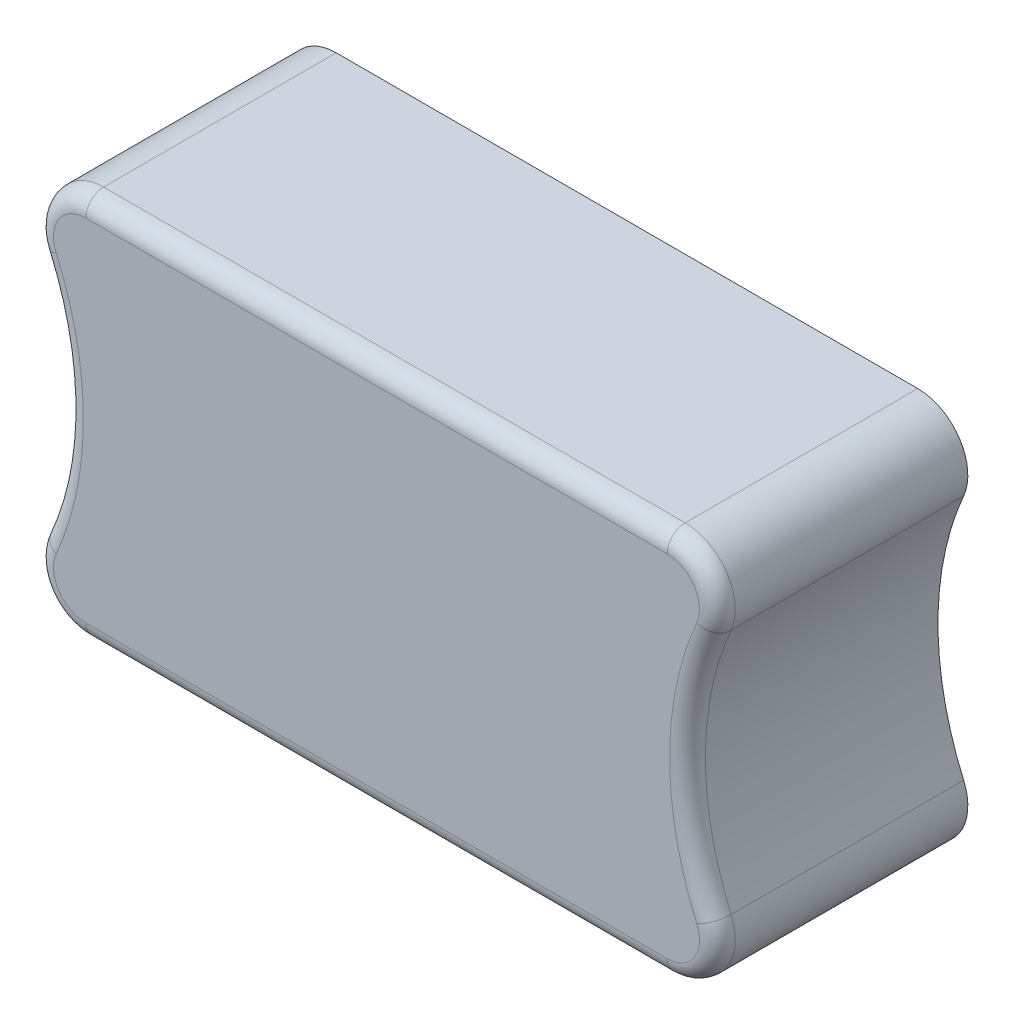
ISO-10303-21;
HEADER;
FILE_DESCRIPTION(('STEP AP214'),'2;1');
FILE_NAME('part.step','',(''),(''),'','','');
FILE_SCHEMA(('AUTOMOTIVE_DESIGN { 1 0 10303 214 1 1 1 1 }'));
ENDSEC;
DATA;
#1=APPLICATION_CONTEXT('core data for automotive mechanical design processes');
#2=APPLICATION_PROTOCOL_DEFINITION('international standard','automotive_design',2000,#1);
#3=PRODUCT_CONTEXT('',#1,'mechanical');
#4=PRODUCT('Part','Part','',(#3));
#5=PRODUCT_RELATED_PRODUCT_CATEGORY('part','',(#4));
#6=PRODUCT_DEFINITION_FORMATION('','',#4);
#7=PRODUCT_DEFINITION_CONTEXT('part definition',#1,'design');
#8=PRODUCT_DEFINITION('design','',#6,#7);
#9=PRODUCT_DEFINITION_SHAPE('','',#8);
#10=(LENGTH_UNIT() NAMED_UNIT(*) SI_UNIT(.MILLI.,.METRE.));
#11=(NAMED_UNIT(*) PLANE_ANGLE_UNIT() SI_UNIT($,.RADIAN.));
#12=(NAMED_UNIT(*) SI_UNIT($,.STERADIAN.) SOLID_ANGLE_UNIT());
#13=UNCERTAINTY_MEASURE_WITH_UNIT(LENGTH_MEASURE(1.E-05),#10,'distance_accuracy_value','');
#14=(GEOMETRIC_REPRESENTATION_CONTEXT(3) GLOBAL_UNCERTAINTY_ASSIGNED_CONTEXT((#13)) GLOBAL_UNIT_ASSIGNED_CONTEXT((#10,
#11,#12)) REPRESENTATION_CONTEXT('',''));
#15=CARTESIAN_POINT('',(0.,0.,0.));
#16=DIRECTION('',(0.,0.,1.));
#17=DIRECTION('',(1.,0.,0.));
#18=AXIS2_PLACEMENT_3D('',#15,#16,#17);
#19=CARTESIAN_POINT('',(86.4575131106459,0.,-35.));
#20=DIRECTION('',(0.,0.,1.));
#21=DIRECTION('',(1.,0.,0.));
#22=AXIS2_PLACEMENT_3D('',#19,#20,#21);
#23=CYLINDRICAL_SURFACE('',#22,43.);
#24=DIRECTION('',(0.,0.,1.));
#25=VECTOR('',#24,1.);
#26=CARTESIAN_POINT('',(47.0473621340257,17.2,-35.));
#27=LINE('',#26,#25);
#28=CARTESIAN_POINT('',(47.0473621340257,17.2,-35.));
#29=VERTEX_POINT('',#28);
#30=CARTESIAN_POINT('',(47.0473621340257,17.2,-2.5));
#31=VERTEX_POINT('',#30);
#32=EDGE_CURVE('E272',#29,#31,#27,.T.);
#33=ORIENTED_EDGE('',*,*,#32,.T.);
#34=CARTESIAN_POINT('',(86.4575131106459,0.,-2.5));
#35=DIRECTION('',(0.,0.,1.));
#36=DIRECTION('',(1.,0.,0.));
#37=AXIS2_PLACEMENT_3D('',#34,#35,#36);
#38=CIRCLE('',#37,43.);
#39=CARTESIAN_POINT('',(47.0473621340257,-17.2,-2.5));
#40=VERTEX_POINT('',#39);
#41=EDGE_CURVE('E11',#31,#40,#38,.T.);
#42=ORIENTED_EDGE('',*,*,#41,.T.);
#43=DIRECTION('',(0.,0.,1.));
#44=VECTOR('',#43,1.);
#45=CARTESIAN_POINT('',(47.0473621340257,-17.2,-35.));
#46=LINE('',#45,#44);
#47=CARTESIAN_POINT('',(47.0473621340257,-17.2,-35.));
#48=VERTEX_POINT('',#47);
#49=EDGE_CURVE('E273',#48,#40,#46,.T.);
#50=ORIENTED_EDGE('',*,*,#49,.F.);
#51=CARTESIAN_POINT('',(86.4575131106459,0.,-35.));
#52=DIRECTION('',(0.,0.,-1.));
#53=DIRECTION('',(1.,0.,0.));
#54=AXIS2_PLACEMENT_3D('',#51,#52,#53);
#55=CIRCLE('',#54,43.);
#56=EDGE_CURVE('E248',#48,#29,#55,.T.);
#57=ORIENTED_EDGE('',*,*,#56,.T.);
#58=EDGE_LOOP('',(#33,#42,#50,#57));
#59=FACE_BOUND('',#58,.T.);
#60=ADVANCED_FACE('F37',(#59),#23,.F.);
#61=CARTESIAN_POINT('',(40.6317561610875,-20.,-35.));
#62=DIRECTION('',(0.,0.,1.));
#63=DIRECTION('',(1.,0.,0.));
#64=AXIS2_PLACEMENT_3D('',#61,#62,#63);
#65=CYLINDRICAL_SURFACE('',#64,7.);
#66=ORIENTED_EDGE('',*,*,#49,.T.);
#67=CARTESIAN_POINT('',(40.6317561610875,-20.,-2.5));
#68=DIRECTION('',(0.,0.,1.));
#69=DIRECTION('',(1.,0.,0.));
#70=AXIS2_PLACEMENT_3D('',#67,#68,#69);
#71=CIRCLE('',#70,7.);
#72=CARTESIAN_POINT('',(40.6317561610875,-27.,-2.5));
#73=VERTEX_POINT('',#72);
#74=EDGE_CURVE('E311',#40,#73,#71,.F.);
#75=ORIENTED_EDGE('',*,*,#74,.T.);
#76=DIRECTION('',(0.,0.,1.));
#77=VECTOR('',#76,1.);
#78=CARTESIAN_POINT('',(40.6317561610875,-27.,-35.));
#79=LINE('',#78,#77);
#80=CARTESIAN_POINT('',(40.6317561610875,-27.,-35.));
#81=VERTEX_POINT('',#80);
#82=EDGE_CURVE('E277',#81,#73,#79,.T.);
#83=ORIENTED_EDGE('',*,*,#82,.F.);
#84=CARTESIAN_POINT('',(40.6317561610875,-20.,-35.));
#85=DIRECTION('',(0.,0.,1.));
#86=DIRECTION('',(1.,0.,0.));
#87=AXIS2_PLACEMENT_3D('',#84,#85,#86);
#88=CIRCLE('',#87,7.);
#89=EDGE_CURVE('E269',#81,#48,#88,.T.);
#90=ORIENTED_EDGE('',*,*,#89,.T.);
#91=EDGE_LOOP('',(#66,#75,#83,#90));
#92=FACE_BOUND('',#91,.T.);
#93=ADVANCED_FACE('F385',(#92),#65,.T.);
#94=CARTESIAN_POINT('',(40.6317561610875,-27.,-35.));
#95=DIRECTION('',(0.,-1.,0.));
#96=DIRECTION('',(0.,0.,-1.));
#97=AXIS2_PLACEMENT_3D('',#94,#95,#96);
#98=PLANE('',#97);
#99=ORIENTED_EDGE('',*,*,#82,.T.);
#100=DIRECTION('',(1.,0.,0.));
#101=VECTOR('',#100,1.);
#102=CARTESIAN_POINT('',(40.6317561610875,-27.,-2.5));
#103=LINE('',#102,#101);
#104=CARTESIAN_POINT('',(-40.6317561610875,-27.,-2.5));
#105=VERTEX_POINT('',#104);
#106=EDGE_CURVE('E314',#73,#105,#103,.F.);
#107=ORIENTED_EDGE('',*,*,#106,.T.);
#108=DIRECTION('',(0.,0.,1.));
#109=VECTOR('',#108,1.);
#110=CARTESIAN_POINT('',(-40.6317561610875,-27.,-35.));
#111=LINE('',#110,#109);
#112=CARTESIAN_POINT('',(-40.6317561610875,-27.,-35.));
#113=VERTEX_POINT('',#112);
#114=EDGE_CURVE('E280',#113,#105,#111,.T.);
#115=ORIENTED_EDGE('',*,*,#114,.F.);
#116=DIRECTION('',(1.,0.,0.));
#117=VECTOR('',#116,1.);
#118=CARTESIAN_POINT('',(40.6317561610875,-27.,-35.));
#119=LINE('',#118,#117);
#120=EDGE_CURVE('E266',#113,#81,#119,.T.);
#121=ORIENTED_EDGE('',*,*,#120,.T.);
#122=EDGE_LOOP('',(#99,#107,#115,#121));
#123=FACE_BOUND('',#122,.T.);
#124=ADVANCED_FACE('F387',(#123),#98,.T.);
#125=CARTESIAN_POINT('',(-40.6317561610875,-20.,-35.));
#126=DIRECTION('',(0.,0.,1.));
#127=DIRECTION('',(1.,0.,0.));
#128=AXIS2_PLACEMENT_3D('',#125,#126,#127);
#129=CYLINDRICAL_SURFACE('',#128,7.);
#130=ORIENTED_EDGE('',*,*,#114,.T.);
#131=CARTESIAN_POINT('',(-40.6317561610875,-20.,-2.5));
#132=DIRECTION('',(0.,0.,1.));
#133=DIRECTION('',(1.,0.,0.));
#134=AXIS2_PLACEMENT_3D('',#131,#132,#133);
#135=CIRCLE('',#134,7.);
#136=CARTESIAN_POINT('',(-47.0473621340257,-17.2,-2.5));
#137=VERTEX_POINT('',#136);
#138=EDGE_CURVE('E316',#105,#137,#135,.F.);
#139=ORIENTED_EDGE('',*,*,#138,.T.);
#140=DIRECTION('',(0.,0.,1.));
#141=VECTOR('',#140,1.);
#142=CARTESIAN_POINT('',(-47.0473621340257,-17.2,-35.));
#143=LINE('',#142,#141);
#144=CARTESIAN_POINT('',(-47.0473621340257,-17.2,-35.));
#145=VERTEX_POINT('',#144);
#146=EDGE_CURVE('E283',#145,#137,#143,.T.);
#147=ORIENTED_EDGE('',*,*,#146,.F.);
#148=CARTESIAN_POINT('',(-40.6317561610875,-20.,-35.));
#149=DIRECTION('',(0.,0.,1.));
#150=DIRECTION('',(1.,0.,0.));
#151=AXIS2_PLACEMENT_3D('',#148,#149,#150);
#152=CIRCLE('',#151,7.);
#153=EDGE_CURVE('E263',#145,#113,#152,.T.);
#154=ORIENTED_EDGE('',*,*,#153,.T.);
#155=EDGE_LOOP('',(#130,#139,#147,#154));
#156=FACE_BOUND('',#155,.T.);
#157=ADVANCED_FACE('F392',(#156),#129,.T.);
#158=CARTESIAN_POINT('',(-86.4575131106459,0.,-35.));
#159=DIRECTION('',(0.,0.,1.));
#160=DIRECTION('',(1.,0.,0.));
#161=AXIS2_PLACEMENT_3D('',#158,#159,#160);
#162=CYLINDRICAL_SURFACE('',#161,43.);
#163=ORIENTED_EDGE('',*,*,#146,.T.);
#164=CARTESIAN_POINT('',(-86.4575131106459,0.,-2.5));
#165=DIRECTION('',(0.,0.,1.));
#166=DIRECTION('',(1.,0.,0.));
#167=AXIS2_PLACEMENT_3D('',#164,#165,#166);
#168=CIRCLE('',#167,43.);
#169=CARTESIAN_POINT('',(-47.0473621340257,17.2,-2.5));
#170=VERTEX_POINT('',#169);
#171=EDGE_CURVE('E318',#137,#170,#168,.T.);
#172=ORIENTED_EDGE('',*,*,#171,.T.);
#173=DIRECTION('',(0.,0.,1.));
#174=VECTOR('',#173,1.);
#175=CARTESIAN_POINT('',(-47.0473621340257,17.2,-35.));
#176=LINE('',#175,#174);
#177=CARTESIAN_POINT('',(-47.0473621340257,17.2,-35.));
#178=VERTEX_POINT('',#177);
#179=EDGE_CURVE('E286',#178,#170,#176,.T.);
#180=ORIENTED_EDGE('',*,*,#179,.F.);
#181=CARTESIAN_POINT('',(-86.4575131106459,0.,-35.));
#182=DIRECTION('',(0.,0.,-1.));
#183=DIRECTION('',(1.,0.,0.));
#184=AXIS2_PLACEMENT_3D('',#181,#182,#183);
#185=CIRCLE('',#184,43.);
#186=EDGE_CURVE('E260',#178,#145,#185,.T.);
#187=ORIENTED_EDGE('',*,*,#186,.T.);
#188=EDGE_LOOP('',(#163,#172,#180,#187));
#189=FACE_BOUND('',#188,.T.);
#190=ADVANCED_FACE('F395',(#189),#162,.F.);
#191=CARTESIAN_POINT('',(-40.6317561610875,20.,-35.));
#192=DIRECTION('',(0.,0.,1.));
#193=DIRECTION('',(1.,0.,0.));
#194=AXIS2_PLACEMENT_3D('',#191,#192,#193);
#195=CYLINDRICAL_SURFACE('',#194,7.);
#196=ORIENTED_EDGE('',*,*,#179,.T.);
#197=CARTESIAN_POINT('',(-40.6317561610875,20.,-2.5));
#198=DIRECTION('',(0.,0.,1.));
#199=DIRECTION('',(1.,0.,0.));
#200=AXIS2_PLACEMENT_3D('',#197,#198,#199);
#201=CIRCLE('',#200,7.);
#202=CARTESIAN_POINT('',(-40.6317561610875,27.,-2.5));
#203=VERTEX_POINT('',#202);
#204=EDGE_CURVE('E320',#170,#203,#201,.F.);
#205=ORIENTED_EDGE('',*,*,#204,.T.);
#206=DIRECTION('',(0.,0.,1.));
#207=VECTOR('',#206,1.);
#208=CARTESIAN_POINT('',(-40.6317561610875,27.,-35.));
#209=LINE('',#208,#207);
#210=CARTESIAN_POINT('',(-40.6317561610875,27.,-35.));
#211=VERTEX_POINT('',#210);
#212=EDGE_CURVE('E289',#211,#203,#209,.T.);
#213=ORIENTED_EDGE('',*,*,#212,.F.);
#214=CARTESIAN_POINT('',(-40.6317561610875,20.,-35.));
#215=DIRECTION('',(0.,0.,1.));
#216=DIRECTION('',(1.,0.,0.));
#217=AXIS2_PLACEMENT_3D('',#214,#215,#216);
#218=CIRCLE('',#217,7.);
#219=EDGE_CURVE('E257',#211,#178,#218,.T.);
#220=ORIENTED_EDGE('',*,*,#219,.T.);
#221=EDGE_LOOP('',(#196,#205,#213,#220));
#222=FACE_BOUND('',#221,.T.);
#223=ADVANCED_FACE('F356',(#222),#195,.T.);
#224=CARTESIAN_POINT('',(-40.6317561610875,27.,-35.));
#225=DIRECTION('',(0.,1.,0.));
#226=DIRECTION('',(0.,0.,1.));
#227=AXIS2_PLACEMENT_3D('',#224,#225,#226);
#228=PLANE('',#227);
#229=ORIENTED_EDGE('',*,*,#212,.T.);
#230=DIRECTION('',(-1.,0.,0.));
#231=VECTOR('',#230,1.);
#232=CARTESIAN_POINT('',(-40.6317561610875,27.,-2.5));
#233=LINE('',#232,#231);
#234=CARTESIAN_POINT('',(40.6317561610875,27.,-2.5));
#235=VERTEX_POINT('',#234);
#236=EDGE_CURVE('E322',#203,#235,#233,.F.);
#237=ORIENTED_EDGE('',*,*,#236,.T.);
#238=DIRECTION('',(0.,0.,1.));
#239=VECTOR('',#238,1.);
#240=CARTESIAN_POINT('',(40.6317561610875,27.,-35.));
#241=LINE('',#240,#239);
#242=CARTESIAN_POINT('',(40.6317561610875,27.,-35.));
#243=VERTEX_POINT('',#242);
#244=EDGE_CURVE('E292',#243,#235,#241,.T.);
#245=ORIENTED_EDGE('',*,*,#244,.F.);
#246=DIRECTION('',(-1.,0.,0.));
#247=VECTOR('',#246,1.);
#248=CARTESIAN_POINT('',(-40.6317561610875,27.,-35.));
#249=LINE('',#248,#247);
#250=EDGE_CURVE('E254',#243,#211,#249,.T.);
#251=ORIENTED_EDGE('',*,*,#250,.T.);
#252=EDGE_LOOP('',(#229,#237,#245,#251));
#253=FACE_BOUND('',#252,.T.);
#254=ADVANCED_FACE('F359',(#253),#228,.T.);
#255=CARTESIAN_POINT('',(40.6317561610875,20.,-35.));
#256=DIRECTION('',(0.,0.,1.));
#257=DIRECTION('',(1.,0.,0.));
#258=AXIS2_PLACEMENT_3D('',#255,#256,#257);
#259=CYLINDRICAL_SURFACE('',#258,7.);
#260=ORIENTED_EDGE('',*,*,#244,.T.);
#261=CARTESIAN_POINT('',(40.6317561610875,20.,-2.5));
#262=DIRECTION('',(0.,0.,1.));
#263=DIRECTION('',(1.,0.,0.));
#264=AXIS2_PLACEMENT_3D('',#261,#262,#263);
#265=CIRCLE('',#264,7.);
#266=EDGE_CURVE('E46',#235,#31,#265,.F.);
#267=ORIENTED_EDGE('',*,*,#266,.T.);
#268=ORIENTED_EDGE('',*,*,#32,.F.);
#269=CARTESIAN_POINT('',(40.6317561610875,20.,-35.));
#270=DIRECTION('',(0.,0.,1.));
#271=DIRECTION('',(1.,0.,0.));
#272=AXIS2_PLACEMENT_3D('',#269,#270,#271);
#273=CIRCLE('',#272,7.);
#274=EDGE_CURVE('E251',#29,#243,#273,.T.);
#275=ORIENTED_EDGE('',*,*,#274,.T.);
#276=EDGE_LOOP('',(#260,#267,#268,#275));
#277=FACE_BOUND('',#276,.T.);
#278=ADVANCED_FACE('F366',(#277),#259,.T.);
#279=CARTESIAN_POINT('',(86.4575131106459,0.,-35.));
#280=DIRECTION('',(0.,0.,1.));
#281=DIRECTION('',(1.,0.,0.));
#282=AXIS2_PLACEMENT_3D('',#279,#280,#281);
#283=PLANE('',#282);
#284=CARTESIAN_POINT('',(40.6317561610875,-20.,-35.));
#285=DIRECTION('',(0.,0.,1.));
#286=DIRECTION('',(1.,0.,0.));
#287=AXIS2_PLACEMENT_3D('',#284,#285,#286);
#288=CIRCLE('',#287,4.);
#289=CARTESIAN_POINT('',(40.6317561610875,-24.,-35.));
#290=VERTEX_POINT('',#289);
#291=CARTESIAN_POINT('',(44.2978167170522,-18.4,-35.));
#292=VERTEX_POINT('',#291);
#293=EDGE_CURVE('E200',#290,#292,#288,.T.);
#294=ORIENTED_EDGE('',*,*,#293,.T.);
#295=CARTESIAN_POINT('',(86.4575131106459,0.,-35.));
#296=DIRECTION('',(0.,0.,1.));
#297=DIRECTION('',(1.,0.,0.));
#298=AXIS2_PLACEMENT_3D('',#295,#296,#297);
#299=CIRCLE('',#298,46.);
#300=CARTESIAN_POINT('',(44.2978167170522,18.4,-35.));
#301=VERTEX_POINT('',#300);
#302=EDGE_CURVE('E233',#292,#301,#299,.F.);
#303=ORIENTED_EDGE('',*,*,#302,.T.);
#304=CARTESIAN_POINT('',(40.6317561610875,20.,-35.));
#305=DIRECTION('',(0.,0.,1.));
#306=DIRECTION('',(1.,0.,0.));
#307=AXIS2_PLACEMENT_3D('',#304,#305,#306);
#308=CIRCLE('',#307,4.);
#309=CARTESIAN_POINT('',(40.6317561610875,24.,-35.));
#310=VERTEX_POINT('',#309);
#311=EDGE_CURVE('E197',#301,#310,#308,.T.);
#312=ORIENTED_EDGE('',*,*,#311,.T.);
#313=DIRECTION('',(-1.,0.,0.));
#314=VECTOR('',#313,1.);
#315=CARTESIAN_POINT('',(86.4575131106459,24.,-35.));
#316=LINE('',#315,#314);
#317=CARTESIAN_POINT('',(-40.6317561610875,24.,-35.));
#318=VERTEX_POINT('',#317);
#319=EDGE_CURVE('E54',#310,#318,#316,.T.);
#320=ORIENTED_EDGE('',*,*,#319,.T.);
#321=CARTESIAN_POINT('',(-40.6317561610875,20.,-35.));
#322=DIRECTION('',(0.,0.,1.));
#323=DIRECTION('',(1.,0.,0.));
#324=AXIS2_PLACEMENT_3D('',#321,#322,#323);
#325=CIRCLE('',#324,4.);
#326=CARTESIAN_POINT('',(-44.2978167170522,18.4,-35.));
#327=VERTEX_POINT('',#326);
#328=EDGE_CURVE('E243',#318,#327,#325,.T.);
#329=ORIENTED_EDGE('',*,*,#328,.T.);
#330=CARTESIAN_POINT('',(-86.4575131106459,0.,-35.));
#331=DIRECTION('',(0.,0.,1.));
#332=DIRECTION('',(1.,0.,0.));
#333=AXIS2_PLACEMENT_3D('',#330,#331,#332);
#334=CIRCLE('',#333,46.);
#335=CARTESIAN_POINT('',(-44.2978167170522,-18.4,-35.));
#336=VERTEX_POINT('',#335);
#337=EDGE_CURVE('E240',#327,#336,#334,.F.);
#338=ORIENTED_EDGE('',*,*,#337,.T.);
#339=CARTESIAN_POINT('',(-40.6317561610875,-20.,-35.));
#340=DIRECTION('',(0.,0.,1.));
#341=DIRECTION('',(1.,0.,0.));
#342=AXIS2_PLACEMENT_3D('',#339,#340,#341);
#343=CIRCLE('',#342,4.);
#344=CARTESIAN_POINT('',(-40.6317561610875,-24.,-35.));
#345=VERTEX_POINT('',#344);
#346=EDGE_CURVE('E237',#336,#345,#343,.T.);
#347=ORIENTED_EDGE('',*,*,#346,.T.);
#348=DIRECTION('',(1.,0.,0.));
#349=VECTOR('',#348,1.);
#350=CARTESIAN_POINT('',(86.4575131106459,-24.,-35.));
#351=LINE('',#350,#349);
#352=EDGE_CURVE('E205',#345,#290,#351,.T.);
#353=ORIENTED_EDGE('',*,*,#352,.T.);
#354=EDGE_LOOP('',(#294,#303,#312,#320,#329,#338,#347,#353));
#355=FACE_BOUND('',#354,.T.);
#356=ORIENTED_EDGE('',*,*,#56,.F.);
#357=ORIENTED_EDGE('',*,*,#89,.F.);
#358=ORIENTED_EDGE('',*,*,#120,.F.);
#359=ORIENTED_EDGE('',*,*,#153,.F.);
#360=ORIENTED_EDGE('',*,*,#186,.F.);
#361=ORIENTED_EDGE('',*,*,#219,.F.);
#362=ORIENTED_EDGE('',*,*,#250,.F.);
#363=ORIENTED_EDGE('',*,*,#274,.F.);
#364=EDGE_LOOP('',(#356,#357,#358,#359,#360,#361,#362,#363));
#365=FACE_BOUND('',#364,.T.);
#366=ADVANCED_FACE('F364',(#355,#365),#283,.F.);
#367=CARTESIAN_POINT('',(86.4575131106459,0.,0.));
#368=DIRECTION('',(0.,0.,1.));
#369=DIRECTION('',(1.,0.,0.));
#370=AXIS2_PLACEMENT_3D('',#367,#368,#369);
#371=PLANE('',#370);
#372=DIRECTION('',(1.,0.,0.));
#373=VECTOR('',#372,1.);
#374=CARTESIAN_POINT('',(86.4575131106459,-24.5,0.));
#375=LINE('',#374,#373);
#376=CARTESIAN_POINT('',(-40.6317561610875,-24.5,0.));
#377=VERTEX_POINT('',#376);
#378=CARTESIAN_POINT('',(40.6317561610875,-24.5,0.));
#379=VERTEX_POINT('',#378);
#380=EDGE_CURVE('E306',#377,#379,#375,.T.);
#381=ORIENTED_EDGE('',*,*,#380,.T.);
#382=CARTESIAN_POINT('',(40.6317561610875,-20.,0.));
#383=DIRECTION('',(0.,0.,1.));
#384=DIRECTION('',(1.,0.,0.));
#385=AXIS2_PLACEMENT_3D('',#382,#383,#384);
#386=CIRCLE('',#385,4.5);
#387=CARTESIAN_POINT('',(44.7560742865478,-18.2,0.));
#388=VERTEX_POINT('',#387);
#389=EDGE_CURVE('E308',#379,#388,#386,.T.);
#390=ORIENTED_EDGE('',*,*,#389,.T.);
#391=CARTESIAN_POINT('',(86.4575131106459,0.,0.));
#392=DIRECTION('',(0.,0.,1.));
#393=DIRECTION('',(1.,0.,0.));
#394=AXIS2_PLACEMENT_3D('',#391,#392,#393);
#395=CIRCLE('',#394,45.5);
#396=CARTESIAN_POINT('',(44.7560742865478,18.2,0.));
#397=VERTEX_POINT('',#396);
#398=EDGE_CURVE('E276',#388,#397,#395,.F.);
#399=ORIENTED_EDGE('',*,*,#398,.T.);
#400=CARTESIAN_POINT('',(40.6317561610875,20.,0.));
#401=DIRECTION('',(0.,0.,1.));
#402=DIRECTION('',(1.,0.,0.));
#403=AXIS2_PLACEMENT_3D('',#400,#401,#402);
#404=CIRCLE('',#403,4.5);
#405=CARTESIAN_POINT('',(40.6317561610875,24.5,0.));
#406=VERTEX_POINT('',#405);
#407=EDGE_CURVE('E296',#397,#406,#404,.T.);
#408=ORIENTED_EDGE('',*,*,#407,.T.);
#409=DIRECTION('',(-1.,0.,0.));
#410=VECTOR('',#409,1.);
#411=CARTESIAN_POINT('',(86.4575131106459,24.5,0.));
#412=LINE('',#411,#410);
#413=CARTESIAN_POINT('',(-40.6317561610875,24.5,0.));
#414=VERTEX_POINT('',#413);
#415=EDGE_CURVE('E298',#406,#414,#412,.T.);
#416=ORIENTED_EDGE('',*,*,#415,.T.);
#417=CARTESIAN_POINT('',(-40.6317561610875,20.,0.));
#418=DIRECTION('',(0.,0.,1.));
#419=DIRECTION('',(1.,0.,0.));
#420=AXIS2_PLACEMENT_3D('',#417,#418,#419);
#421=CIRCLE('',#420,4.5);
#422=CARTESIAN_POINT('',(-44.7560742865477,18.2,0.));
#423=VERTEX_POINT('',#422);
#424=EDGE_CURVE('E300',#414,#423,#421,.T.);
#425=ORIENTED_EDGE('',*,*,#424,.T.);
#426=CARTESIAN_POINT('',(-86.4575131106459,0.,0.));
#427=DIRECTION('',(0.,0.,1.));
#428=DIRECTION('',(1.,0.,0.));
#429=AXIS2_PLACEMENT_3D('',#426,#427,#428);
#430=CIRCLE('',#429,45.5);
#431=CARTESIAN_POINT('',(-44.7560742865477,-18.2,0.));
#432=VERTEX_POINT('',#431);
#433=EDGE_CURVE('E302',#423,#432,#430,.F.);
#434=ORIENTED_EDGE('',*,*,#433,.T.);
#435=CARTESIAN_POINT('',(-40.6317561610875,-20.,0.));
#436=DIRECTION('',(0.,0.,1.));
#437=DIRECTION('',(1.,0.,0.));
#438=AXIS2_PLACEMENT_3D('',#435,#436,#437);
#439=CIRCLE('',#438,4.5);
#440=EDGE_CURVE('E304',#432,#377,#439,.T.);
#441=ORIENTED_EDGE('',*,*,#440,.T.);
#442=EDGE_LOOP('',(#381,#390,#399,#408,#416,#425,#434,#441));
#443=FACE_BOUND('',#442,.T.);
#444=ADVANCED_FACE('F433',(#443),#371,.T.);
#445=CARTESIAN_POINT('',(-40.6317561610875,20.,-2.5));
#446=DIRECTION('',(0.,0.,1.));
#447=DIRECTION('',(1.,0.,0.));
#448=AXIS2_PLACEMENT_3D('',#445,#446,#447);
#449=TOROIDAL_SURFACE('',#448,4.5,2.5);
#450=CARTESIAN_POINT('',(-40.6317561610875,24.5,-2.5));
#451=DIRECTION('',(1.,0.,0.));
#452=DIRECTION('',(0.,0.,-1.));
#453=AXIS2_PLACEMENT_3D('',#450,#451,#452);
#454=CIRCLE('',#453,2.5);
#455=EDGE_CURVE('E339',#203,#414,#454,.T.);
#456=ORIENTED_EDGE('',*,*,#455,.F.);
#457=ORIENTED_EDGE('',*,*,#204,.F.);
#458=CARTESIAN_POINT('',(-44.7560742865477,18.2,-2.5));
#459=DIRECTION('',(0.4,-0.916515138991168,0.));
#460=DIRECTION('',(0.916515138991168,0.4,0.));
#461=AXIS2_PLACEMENT_3D('',#458,#459,#460);
#462=CIRCLE('',#461,2.5);
#463=EDGE_CURVE('E41',#423,#170,#462,.T.);
#464=ORIENTED_EDGE('',*,*,#463,.F.);
#465=ORIENTED_EDGE('',*,*,#424,.F.);
#466=EDGE_LOOP('',(#456,#457,#464,#465));
#467=FACE_BOUND('',#466,.T.);
#468=ADVANCED_FACE('F39',(#467),#449,.T.);
#469=CARTESIAN_POINT('',(-86.4575131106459,0.,-2.5));
#470=DIRECTION('',(0.,0.,1.));
#471=DIRECTION('',(1.,0.,0.));
#472=AXIS2_PLACEMENT_3D('',#469,#470,#471);
#473=TOROIDAL_SURFACE('',#472,45.5,2.5);
#474=ORIENTED_EDGE('',*,*,#463,.T.);
#475=ORIENTED_EDGE('',*,*,#171,.F.);
#476=CARTESIAN_POINT('',(-44.7560742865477,-18.2,-2.5));
#477=DIRECTION('',(-0.399999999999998,-0.916515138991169,0.));
#478=DIRECTION('',(0.916515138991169,-0.399999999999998,0.));
#479=AXIS2_PLACEMENT_3D('',#476,#477,#478);
#480=CIRCLE('',#479,2.5);
#481=EDGE_CURVE('E337',#432,#137,#480,.T.);
#482=ORIENTED_EDGE('',*,*,#481,.F.);
#483=ORIENTED_EDGE('',*,*,#433,.F.);
#484=EDGE_LOOP('',(#474,#475,#482,#483));
#485=FACE_BOUND('',#484,.T.);
#486=ADVANCED_FACE('F350',(#485),#473,.T.);
#487=CARTESIAN_POINT('',(86.4575131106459,24.5,-2.5));
#488=DIRECTION('',(-1.,0.,0.));
#489=DIRECTION('',(0.,0.,1.));
#490=AXIS2_PLACEMENT_3D('',#487,#488,#489);
#491=CYLINDRICAL_SURFACE('',#490,2.5);
#492=ORIENTED_EDGE('',*,*,#455,.T.);
#493=ORIENTED_EDGE('',*,*,#415,.F.);
#494=CARTESIAN_POINT('',(40.6317561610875,24.5,-2.5));
#495=DIRECTION('',(1.,0.,0.));
#496=DIRECTION('',(0.,0.,-1.));
#497=AXIS2_PLACEMENT_3D('',#494,#495,#496);
#498=CIRCLE('',#497,2.5);
#499=EDGE_CURVE('E334',#235,#406,#498,.T.);
#500=ORIENTED_EDGE('',*,*,#499,.F.);
#501=ORIENTED_EDGE('',*,*,#236,.F.);
#502=EDGE_LOOP('',(#492,#493,#500,#501));
#503=FACE_BOUND('',#502,.T.);
#504=ADVANCED_FACE('F426',(#503),#491,.T.);
#505=CARTESIAN_POINT('',(-40.6317561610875,-20.,-2.5));
#506=DIRECTION('',(0.,0.,1.));
#507=DIRECTION('',(1.,0.,0.));
#508=AXIS2_PLACEMENT_3D('',#505,#506,#507);
#509=TOROIDAL_SURFACE('',#508,4.5,2.5);
#510=ORIENTED_EDGE('',*,*,#481,.T.);
#511=ORIENTED_EDGE('',*,*,#138,.F.);
#512=CARTESIAN_POINT('',(-40.6317561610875,-24.5,-2.5));
#513=DIRECTION('',(1.,0.,0.));
#514=DIRECTION('',(0.,0.,-1.));
#515=AXIS2_PLACEMENT_3D('',#512,#513,#514);
#516=CIRCLE('',#515,2.5);
#517=EDGE_CURVE('E331',#377,#105,#516,.T.);
#518=ORIENTED_EDGE('',*,*,#517,.F.);
#519=ORIENTED_EDGE('',*,*,#440,.F.);
#520=EDGE_LOOP('',(#510,#511,#518,#519));
#521=FACE_BOUND('',#520,.T.);
#522=ADVANCED_FACE('F423',(#521),#509,.T.);
#523=CARTESIAN_POINT('',(40.6317561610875,20.,-2.5));
#524=DIRECTION('',(0.,0.,1.));
#525=DIRECTION('',(1.,0.,0.));
#526=AXIS2_PLACEMENT_3D('',#523,#524,#525);
#527=TOROIDAL_SURFACE('',#526,4.5,2.5);
#528=ORIENTED_EDGE('',*,*,#499,.T.);
#529=ORIENTED_EDGE('',*,*,#407,.F.);
#530=CARTESIAN_POINT('',(44.7560742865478,18.2,-2.5));
#531=DIRECTION('',(-0.400000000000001,-0.916515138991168,0.));
#532=DIRECTION('',(0.916515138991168,-0.400000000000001,0.));
#533=AXIS2_PLACEMENT_3D('',#530,#531,#532);
#534=CIRCLE('',#533,2.5);
#535=EDGE_CURVE('E328',#31,#397,#534,.T.);
#536=ORIENTED_EDGE('',*,*,#535,.F.);
#537=ORIENTED_EDGE('',*,*,#266,.F.);
#538=EDGE_LOOP('',(#528,#529,#536,#537));
#539=FACE_BOUND('',#538,.T.);
#540=ADVANCED_FACE('F373',(#539),#527,.T.);
#541=CARTESIAN_POINT('',(86.4575131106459,-24.5,-2.5));
#542=DIRECTION('',(1.,0.,0.));
#543=DIRECTION('',(0.,0.,-1.));
#544=AXIS2_PLACEMENT_3D('',#541,#542,#543);
#545=CYLINDRICAL_SURFACE('',#544,2.5);
#546=ORIENTED_EDGE('',*,*,#517,.T.);
#547=ORIENTED_EDGE('',*,*,#106,.F.);
#548=CARTESIAN_POINT('',(40.6317561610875,-24.5,-2.5));
#549=DIRECTION('',(1.,0.,0.));
#550=DIRECTION('',(0.,0.,-1.));
#551=AXIS2_PLACEMENT_3D('',#548,#549,#550);
#552=CIRCLE('',#551,2.5);
#553=EDGE_CURVE('E326',#379,#73,#552,.T.);
#554=ORIENTED_EDGE('',*,*,#553,.F.);
#555=ORIENTED_EDGE('',*,*,#380,.F.);
#556=EDGE_LOOP('',(#546,#547,#554,#555));
#557=FACE_BOUND('',#556,.T.);
#558=ADVANCED_FACE('F417',(#557),#545,.T.);
#559=CARTESIAN_POINT('',(86.4575131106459,0.,-2.5));
#560=DIRECTION('',(0.,0.,1.));
#561=DIRECTION('',(1.,0.,0.));
#562=AXIS2_PLACEMENT_3D('',#559,#560,#561);
#563=TOROIDAL_SURFACE('',#562,45.5,2.5);
#564=ORIENTED_EDGE('',*,*,#535,.T.);
#565=ORIENTED_EDGE('',*,*,#398,.F.);
#566=CARTESIAN_POINT('',(44.7560742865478,-18.2,-2.5));
#567=DIRECTION('',(0.400000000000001,-0.916515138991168,0.));
#568=DIRECTION('',(0.916515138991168,0.400000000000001,0.));
#569=AXIS2_PLACEMENT_3D('',#566,#567,#568);
#570=CIRCLE('',#569,2.5);
#571=EDGE_CURVE('E229',#40,#388,#570,.T.);
#572=ORIENTED_EDGE('',*,*,#571,.F.);
#573=ORIENTED_EDGE('',*,*,#41,.F.);
#574=EDGE_LOOP('',(#564,#565,#572,#573));
#575=FACE_BOUND('',#574,.T.);
#576=ADVANCED_FACE('F377',(#575),#563,.T.);
#577=CARTESIAN_POINT('',(40.6317561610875,-20.,-2.5));
#578=DIRECTION('',(0.,0.,1.));
#579=DIRECTION('',(1.,0.,0.));
#580=AXIS2_PLACEMENT_3D('',#577,#578,#579);
#581=TOROIDAL_SURFACE('',#580,4.5,2.5);
#582=ORIENTED_EDGE('',*,*,#553,.T.);
#583=ORIENTED_EDGE('',*,*,#74,.F.);
#584=ORIENTED_EDGE('',*,*,#571,.T.);
#585=ORIENTED_EDGE('',*,*,#389,.F.);
#586=EDGE_LOOP('',(#582,#583,#584,#585));
#587=FACE_BOUND('',#586,.T.);
#588=ADVANCED_FACE('F381',(#587),#581,.T.);
#589=CARTESIAN_POINT('',(86.4575131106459,0.,-35.));
#590=DIRECTION('',(0.,0.,1.));
#591=DIRECTION('',(1.,0.,0.));
#592=AXIS2_PLACEMENT_3D('',#589,#590,#591);
#593=CYLINDRICAL_SURFACE('',#592,46.);
#594=DIRECTION('',(0.,0.,1.));
#595=VECTOR('',#594,1.);
#596=CARTESIAN_POINT('',(44.2978167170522,18.4,-35.));
#597=LINE('',#596,#595);
#598=CARTESIAN_POINT('',(44.2978167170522,18.4,-3.));
#599=VERTEX_POINT('',#598);
#600=EDGE_CURVE('E181',#301,#599,#597,.T.);
#601=ORIENTED_EDGE('',*,*,#600,.F.);
#602=ORIENTED_EDGE('',*,*,#302,.F.);
#603=DIRECTION('',(0.,0.,1.));
#604=VECTOR('',#603,1.);
#605=CARTESIAN_POINT('',(44.2978167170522,-18.4,-35.));
#606=LINE('',#605,#604);
#607=CARTESIAN_POINT('',(44.2978167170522,-18.4,-3.));
#608=VERTEX_POINT('',#607);
#609=EDGE_CURVE('E183',#292,#608,#606,.T.);
#610=ORIENTED_EDGE('',*,*,#609,.T.);
#611=CARTESIAN_POINT('',(86.4575131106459,0.,-3.));
#612=DIRECTION('',(0.,0.,1.));
#613=DIRECTION('',(1.,0.,0.));
#614=AXIS2_PLACEMENT_3D('',#611,#612,#613);
#615=CIRCLE('',#614,46.);
#616=EDGE_CURVE('E176',#608,#599,#615,.F.);
#617=ORIENTED_EDGE('',*,*,#616,.T.);
#618=EDGE_LOOP('',(#601,#602,#610,#617));
#619=FACE_BOUND('',#618,.T.);
#620=ADVANCED_FACE('F178',(#619),#593,.T.);
#621=CARTESIAN_POINT('',(40.6317561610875,-20.,-35.));
#622=DIRECTION('',(0.,0.,1.));
#623=DIRECTION('',(1.,0.,0.));
#624=AXIS2_PLACEMENT_3D('',#621,#622,#623);
#625=CYLINDRICAL_SURFACE('',#624,4.);
#626=ORIENTED_EDGE('',*,*,#609,.F.);
#627=ORIENTED_EDGE('',*,*,#293,.F.);
#628=DIRECTION('',(0.,0.,-1.));
#629=VECTOR('',#628,1.);
#630=CARTESIAN_POINT('',(40.6317561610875,-24.,-35.));
#631=LINE('',#630,#629);
#632=CARTESIAN_POINT('',(40.6317561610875,-24.,-3.));
#633=VERTEX_POINT('',#632);
#634=EDGE_CURVE('E209',#290,#633,#631,.F.);
#635=ORIENTED_EDGE('',*,*,#634,.T.);
#636=CARTESIAN_POINT('',(40.6317561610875,-20.,-3.));
#637=DIRECTION('',(0.,0.,1.));
#638=DIRECTION('',(1.,0.,0.));
#639=AXIS2_PLACEMENT_3D('',#636,#637,#638);
#640=CIRCLE('',#639,4.);
#641=EDGE_CURVE('E210',#608,#633,#640,.F.);
#642=ORIENTED_EDGE('',*,*,#641,.F.);
#643=EDGE_LOOP('',(#626,#627,#635,#642));
#644=FACE_BOUND('',#643,.T.);
#645=ADVANCED_FACE('F557',(#644),#625,.F.);
#646=CARTESIAN_POINT('',(40.6317561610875,-24.,-35.));
#647=DIRECTION('',(0.,-1.,0.));
#648=DIRECTION('',(0.,0.,-1.));
#649=AXIS2_PLACEMENT_3D('',#646,#647,#648);
#650=PLANE('',#649);
#651=ORIENTED_EDGE('',*,*,#634,.F.);
#652=ORIENTED_EDGE('',*,*,#352,.F.);
#653=DIRECTION('',(0.,0.,1.));
#654=VECTOR('',#653,1.);
#655=CARTESIAN_POINT('',(-40.6317561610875,-24.,-35.));
#656=LINE('',#655,#654);
#657=CARTESIAN_POINT('',(-40.6317561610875,-24.,-3.));
#658=VERTEX_POINT('',#657);
#659=EDGE_CURVE('E214',#345,#658,#656,.T.);
#660=ORIENTED_EDGE('',*,*,#659,.T.);
#661=DIRECTION('',(-1.,0.,0.));
#662=VECTOR('',#661,1.);
#663=CARTESIAN_POINT('',(40.6317561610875,-24.,-3.));
#664=LINE('',#663,#662);
#665=EDGE_CURVE('E212',#633,#658,#664,.T.);
#666=ORIENTED_EDGE('',*,*,#665,.F.);
#667=EDGE_LOOP('',(#651,#652,#660,#666));
#668=FACE_BOUND('',#667,.T.);
#669=ADVANCED_FACE('F567',(#668),#650,.F.);
#670=CARTESIAN_POINT('',(-40.6317561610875,-20.,-35.));
#671=DIRECTION('',(0.,0.,1.));
#672=DIRECTION('',(1.,0.,0.));
#673=AXIS2_PLACEMENT_3D('',#670,#671,#672);
#674=CYLINDRICAL_SURFACE('',#673,4.);
#675=ORIENTED_EDGE('',*,*,#659,.F.);
#676=ORIENTED_EDGE('',*,*,#346,.F.);
#677=DIRECTION('',(0.,0.,1.));
#678=VECTOR('',#677,1.);
#679=CARTESIAN_POINT('',(-44.2978167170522,-18.4,-35.));
#680=LINE('',#679,#678);
#681=CARTESIAN_POINT('',(-44.2978167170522,-18.4,-3.));
#682=VERTEX_POINT('',#681);
#683=EDGE_CURVE('E218',#336,#682,#680,.T.);
#684=ORIENTED_EDGE('',*,*,#683,.T.);
#685=CARTESIAN_POINT('',(-40.6317561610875,-20.,-3.));
#686=DIRECTION('',(0.,0.,1.));
#687=DIRECTION('',(1.,0.,0.));
#688=AXIS2_PLACEMENT_3D('',#685,#686,#687);
#689=CIRCLE('',#688,4.);
#690=EDGE_CURVE('E216',#658,#682,#689,.F.);
#691=ORIENTED_EDGE('',*,*,#690,.F.);
#692=EDGE_LOOP('',(#675,#676,#684,#691));
#693=FACE_BOUND('',#692,.T.);
#694=ADVANCED_FACE('F578',(#693),#674,.F.);
#695=CARTESIAN_POINT('',(-86.4575131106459,0.,-35.));
#696=DIRECTION('',(0.,0.,1.));
#697=DIRECTION('',(1.,0.,0.));
#698=AXIS2_PLACEMENT_3D('',#695,#696,#697);
#699=CYLINDRICAL_SURFACE('',#698,46.);
#700=ORIENTED_EDGE('',*,*,#683,.F.);
#701=ORIENTED_EDGE('',*,*,#337,.F.);
#702=DIRECTION('',(0.,0.,1.));
#703=VECTOR('',#702,1.);
#704=CARTESIAN_POINT('',(-44.2978167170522,18.4,-35.));
#705=LINE('',#704,#703);
#706=CARTESIAN_POINT('',(-44.2978167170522,18.4,-3.));
#707=VERTEX_POINT('',#706);
#708=EDGE_CURVE('E223',#327,#707,#705,.T.);
#709=ORIENTED_EDGE('',*,*,#708,.T.);
#710=CARTESIAN_POINT('',(-86.4575131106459,0.,-3.));
#711=DIRECTION('',(0.,0.,1.));
#712=DIRECTION('',(1.,0.,0.));
#713=AXIS2_PLACEMENT_3D('',#710,#711,#712);
#714=CIRCLE('',#713,46.);
#715=EDGE_CURVE('E221',#682,#707,#714,.T.);
#716=ORIENTED_EDGE('',*,*,#715,.F.);
#717=EDGE_LOOP('',(#700,#701,#709,#716));
#718=FACE_BOUND('',#717,.T.);
#719=ADVANCED_FACE('F589',(#718),#699,.T.);
#720=CARTESIAN_POINT('',(-40.6317561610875,20.,-35.));
#721=DIRECTION('',(0.,0.,1.));
#722=DIRECTION('',(1.,0.,0.));
#723=AXIS2_PLACEMENT_3D('',#720,#721,#722);
#724=CYLINDRICAL_SURFACE('',#723,4.);
#725=ORIENTED_EDGE('',*,*,#708,.F.);
#726=ORIENTED_EDGE('',*,*,#328,.F.);
#727=DIRECTION('',(0.,0.,1.));
#728=VECTOR('',#727,1.);
#729=CARTESIAN_POINT('',(-40.6317561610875,24.,-35.));
#730=LINE('',#729,#728);
#731=CARTESIAN_POINT('',(-40.6317561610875,24.,-3.));
#732=VERTEX_POINT('',#731);
#733=EDGE_CURVE('E202',#318,#732,#730,.T.);
#734=ORIENTED_EDGE('',*,*,#733,.T.);
#735=CARTESIAN_POINT('',(-40.6317561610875,20.,-3.));
#736=DIRECTION('',(0.,0.,1.));
#737=DIRECTION('',(1.,0.,0.));
#738=AXIS2_PLACEMENT_3D('',#735,#736,#737);
#739=CIRCLE('',#738,4.);
#740=EDGE_CURVE('E226',#707,#732,#739,.F.);
#741=ORIENTED_EDGE('',*,*,#740,.F.);
#742=EDGE_LOOP('',(#725,#726,#734,#741));
#743=FACE_BOUND('',#742,.T.);
#744=ADVANCED_FACE('F600',(#743),#724,.F.);
#745=CARTESIAN_POINT('',(-40.6317561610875,24.,-35.));
#746=DIRECTION('',(0.,1.,0.));
#747=DIRECTION('',(0.,0.,1.));
#748=AXIS2_PLACEMENT_3D('',#745,#746,#747);
#749=PLANE('',#748);
#750=ORIENTED_EDGE('',*,*,#733,.F.);
#751=ORIENTED_EDGE('',*,*,#319,.F.);
#752=DIRECTION('',(0.,0.,1.));
#753=VECTOR('',#752,1.);
#754=CARTESIAN_POINT('',(40.6317561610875,24.,-35.));
#755=LINE('',#754,#753);
#756=CARTESIAN_POINT('',(40.6317561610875,24.,-3.));
#757=VERTEX_POINT('',#756);
#758=EDGE_CURVE('E199',#310,#757,#755,.T.);
#759=ORIENTED_EDGE('',*,*,#758,.T.);
#760=DIRECTION('',(-1.,0.,0.));
#761=VECTOR('',#760,1.);
#762=CARTESIAN_POINT('',(86.4575131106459,24.,-3.));
#763=LINE('',#762,#761);
#764=EDGE_CURVE('E192',#757,#732,#763,.T.);
#765=ORIENTED_EDGE('',*,*,#764,.T.);
#766=EDGE_LOOP('',(#750,#751,#759,#765));
#767=FACE_BOUND('',#766,.T.);
#768=ADVANCED_FACE('F611',(#767),#749,.F.);
#769=CARTESIAN_POINT('',(40.6317561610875,20.,-35.));
#770=DIRECTION('',(0.,0.,1.));
#771=DIRECTION('',(1.,0.,0.));
#772=AXIS2_PLACEMENT_3D('',#769,#770,#771);
#773=CYLINDRICAL_SURFACE('',#772,4.);
#774=ORIENTED_EDGE('',*,*,#758,.F.);
#775=ORIENTED_EDGE('',*,*,#311,.F.);
#776=ORIENTED_EDGE('',*,*,#600,.T.);
#777=CARTESIAN_POINT('',(40.6317561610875,20.,-3.));
#778=DIRECTION('',(0.,0.,1.));
#779=DIRECTION('',(1.,0.,0.));
#780=AXIS2_PLACEMENT_3D('',#777,#778,#779);
#781=CIRCLE('',#780,4.);
#782=EDGE_CURVE('E186',#599,#757,#781,.T.);
#783=ORIENTED_EDGE('',*,*,#782,.T.);
#784=EDGE_LOOP('',(#774,#775,#776,#783));
#785=FACE_BOUND('',#784,.T.);
#786=ADVANCED_FACE('F195',(#785),#773,.F.);
#787=CARTESIAN_POINT('',(86.4575131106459,0.,-3.));
#788=DIRECTION('',(0.,0.,1.));
#789=DIRECTION('',(1.,0.,0.));
#790=AXIS2_PLACEMENT_3D('',#787,#788,#789);
#791=PLANE('',#790);
#792=ORIENTED_EDGE('',*,*,#665,.T.);
#793=ORIENTED_EDGE('',*,*,#690,.T.);
#794=ORIENTED_EDGE('',*,*,#715,.T.);
#795=ORIENTED_EDGE('',*,*,#740,.T.);
#796=ORIENTED_EDGE('',*,*,#764,.F.);
#797=ORIENTED_EDGE('',*,*,#782,.F.);
#798=ORIENTED_EDGE('',*,*,#616,.F.);
#799=ORIENTED_EDGE('',*,*,#641,.T.);
#800=EDGE_LOOP('',(#792,#793,#794,#795,#796,#797,#798,#799));
#801=FACE_BOUND('',#800,.T.);
#802=ADVANCED_FACE('F190',(#801),#791,.F.);
#803=CLOSED_SHELL('',(#60,#93,#124,#157,#190,#223,#254,#278,#366,#444,#468,#486,#504,#522,#540,
#558,#576,#588,#620,#645,#669,#694,#719,#744,#768,#786,#802));
#804=MANIFOLD_SOLID_BREP('B2',#803);
#805=ADVANCED_BREP_SHAPE_REPRESENTATION('',(#18,#804),#14);
#806=SHAPE_DEFINITION_REPRESENTATION(#9,#805);
ENDSEC;
END-ISO-10303-21;
